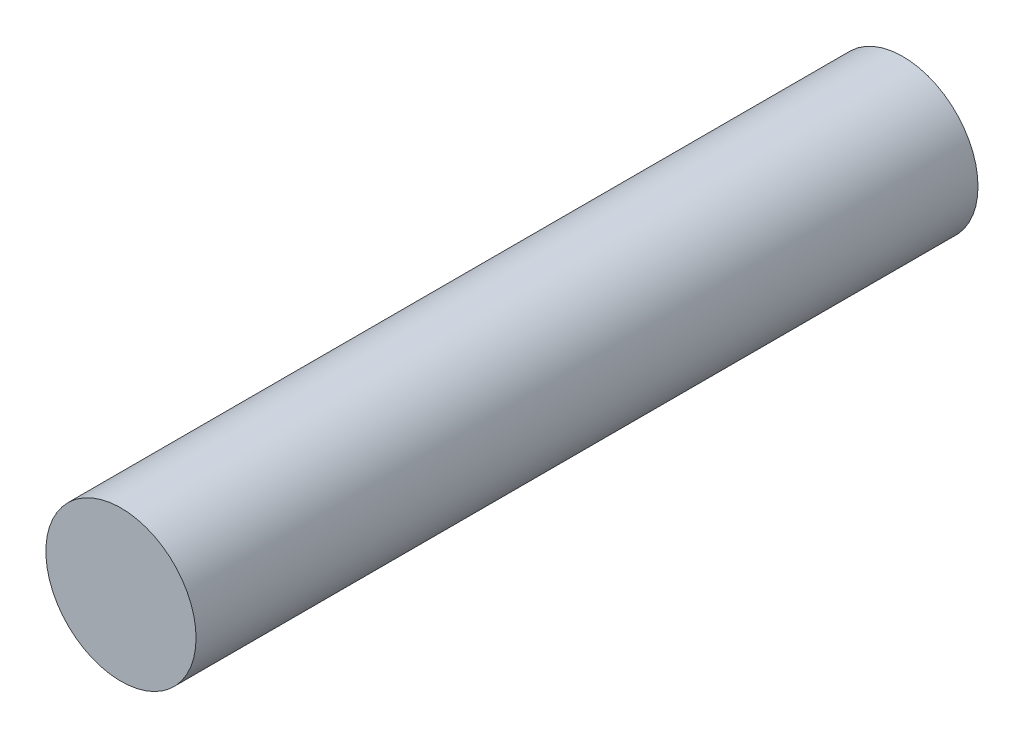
ISO-10303-21;
HEADER;
FILE_DESCRIPTION(('STEP AP214'),'2;1');
FILE_NAME('part.step','',(''),(''),'','','');
FILE_SCHEMA(('AUTOMOTIVE_DESIGN { 1 0 10303 214 1 1 1 1 }'));
ENDSEC;
DATA;
#1=APPLICATION_CONTEXT('core data for automotive mechanical design processes');
#2=APPLICATION_PROTOCOL_DEFINITION('international standard','automotive_design',2000,#1);
#3=PRODUCT_CONTEXT('',#1,'mechanical');
#4=PRODUCT('Part','Part','',(#3));
#5=PRODUCT_RELATED_PRODUCT_CATEGORY('part','',(#4));
#6=PRODUCT_DEFINITION_FORMATION('','',#4);
#7=PRODUCT_DEFINITION_CONTEXT('part definition',#1,'design');
#8=PRODUCT_DEFINITION('design','',#6,#7);
#9=PRODUCT_DEFINITION_SHAPE('','',#8);
#10=(LENGTH_UNIT() NAMED_UNIT(*) SI_UNIT(.MILLI.,.METRE.));
#11=(NAMED_UNIT(*) PLANE_ANGLE_UNIT() SI_UNIT($,.RADIAN.));
#12=(NAMED_UNIT(*) SI_UNIT($,.STERADIAN.) SOLID_ANGLE_UNIT());
#13=UNCERTAINTY_MEASURE_WITH_UNIT(LENGTH_MEASURE(1.E-05),#10,'distance_accuracy_value','');
#14=(GEOMETRIC_REPRESENTATION_CONTEXT(3) GLOBAL_UNCERTAINTY_ASSIGNED_CONTEXT((#13)) GLOBAL_UNIT_ASSIGNED_CONTEXT((#10,
#11,#12)) REPRESENTATION_CONTEXT('',''));
#15=CARTESIAN_POINT('',(0.,0.,0.));
#16=DIRECTION('',(0.,0.,1.));
#17=DIRECTION('',(1.,0.,0.));
#18=AXIS2_PLACEMENT_3D('',#15,#16,#17);
#19=CARTESIAN_POINT('',(0.,0.,41.656));
#20=DIRECTION('',(0.,0.,-1.));
#21=DIRECTION('',(-1.,0.,0.));
#22=AXIS2_PLACEMENT_3D('',#19,#20,#21);
#23=CYLINDRICAL_SURFACE('',#22,4.0005);
#24=CARTESIAN_POINT('',(0.,0.,41.656));
#25=DIRECTION('',(0.,0.,1.));
#26=DIRECTION('',(1.,0.,0.));
#27=AXIS2_PLACEMENT_3D('',#24,#25,#26);
#28=CIRCLE('',#27,4.0005);
#29=CARTESIAN_POINT('',(4.0005,0.,41.656));
#30=VERTEX_POINT('',#29);
#31=EDGE_CURVE('E10',#30,#30,#28,.T.);
#32=ORIENTED_EDGE('',*,*,#31,.F.);
#33=EDGE_LOOP('',(#32));
#34=FACE_BOUND('',#33,.T.);
#35=CARTESIAN_POINT('',(0.,0.,0.));
#36=DIRECTION('',(0.,0.,1.));
#37=DIRECTION('',(1.,0.,0.));
#38=AXIS2_PLACEMENT_3D('',#35,#36,#37);
#39=CIRCLE('',#38,4.0005);
#40=CARTESIAN_POINT('',(4.0005,0.,0.));
#41=VERTEX_POINT('',#40);
#42=EDGE_CURVE('E46',#41,#41,#39,.T.);
#43=ORIENTED_EDGE('',*,*,#42,.T.);
#44=EDGE_LOOP('',(#43));
#45=FACE_BOUND('',#44,.T.);
#46=ADVANCED_FACE('F43',(#34,#45),#23,.T.);
#47=CARTESIAN_POINT('',(0.,0.,41.656));
#48=DIRECTION('',(0.,0.,1.));
#49=DIRECTION('',(1.,0.,0.));
#50=AXIS2_PLACEMENT_3D('',#47,#48,#49);
#51=PLANE('',#50);
#52=ORIENTED_EDGE('',*,*,#31,.T.);
#53=EDGE_LOOP('',(#52));
#54=FACE_BOUND('',#53,.T.);
#55=ADVANCED_FACE('F60',(#54),#51,.T.);
#56=CARTESIAN_POINT('',(0.,0.,0.));
#57=DIRECTION('',(0.,0.,1.));
#58=DIRECTION('',(1.,0.,0.));
#59=AXIS2_PLACEMENT_3D('',#56,#57,#58);
#60=PLANE('',#59);
#61=ORIENTED_EDGE('',*,*,#42,.F.);
#62=EDGE_LOOP('',(#61));
#63=FACE_BOUND('',#62,.T.);
#64=ADVANCED_FACE('F58',(#63),#60,.F.);
#65=CLOSED_SHELL('',(#46,#55,#64));
#66=MANIFOLD_SOLID_BREP('B2',#65);
#67=ADVANCED_BREP_SHAPE_REPRESENTATION('',(#18,#66),#14);
#68=SHAPE_DEFINITION_REPRESENTATION(#9,#67);
ENDSEC;
END-ISO-10303-21;
